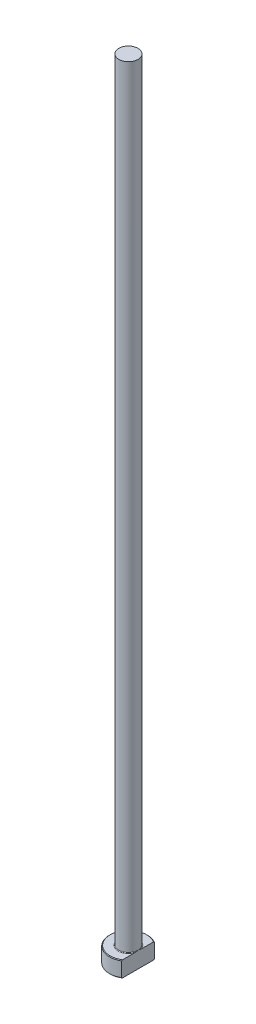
ISO-10303-21;
HEADER;
FILE_DESCRIPTION(('STEP AP214'),'2;1');
FILE_NAME('part.step','',(''),(''),'','','');
FILE_SCHEMA(('AUTOMOTIVE_DESIGN { 1 0 10303 214 1 1 1 1 }'));
ENDSEC;
DATA;
#1=APPLICATION_CONTEXT('core data for automotive mechanical design processes');
#2=APPLICATION_PROTOCOL_DEFINITION('international standard','automotive_design',2000,#1);
#3=PRODUCT_CONTEXT('',#1,'mechanical');
#4=PRODUCT('Part','Part','',(#3));
#5=PRODUCT_RELATED_PRODUCT_CATEGORY('part','',(#4));
#6=PRODUCT_DEFINITION_FORMATION('','',#4);
#7=PRODUCT_DEFINITION_CONTEXT('part definition',#1,'design');
#8=PRODUCT_DEFINITION('design','',#6,#7);
#9=PRODUCT_DEFINITION_SHAPE('','',#8);
#10=(LENGTH_UNIT() NAMED_UNIT(*) SI_UNIT(.MILLI.,.METRE.));
#11=(NAMED_UNIT(*) PLANE_ANGLE_UNIT() SI_UNIT($,.RADIAN.));
#12=(NAMED_UNIT(*) SI_UNIT($,.STERADIAN.) SOLID_ANGLE_UNIT());
#13=UNCERTAINTY_MEASURE_WITH_UNIT(LENGTH_MEASURE(1.E-05),#10,'distance_accuracy_value','');
#14=(GEOMETRIC_REPRESENTATION_CONTEXT(3) GLOBAL_UNCERTAINTY_ASSIGNED_CONTEXT((#13)) GLOBAL_UNIT_ASSIGNED_CONTEXT((#10,
#11,#12)) REPRESENTATION_CONTEXT('',''));
#15=CARTESIAN_POINT('',(0.,0.,0.));
#16=DIRECTION('',(0.,0.,1.));
#17=DIRECTION('',(1.,0.,0.));
#18=AXIS2_PLACEMENT_3D('',#15,#16,#17);
#19=CARTESIAN_POINT('',(0.,0.,0.));
#20=DIRECTION('',(0.,-1.,0.));
#21=DIRECTION('',(0.,0.,-1.));
#22=AXIS2_PLACEMENT_3D('',#19,#20,#21);
#23=PLANE('',#22);
#24=CARTESIAN_POINT('',(0.,0.,0.));
#25=DIRECTION('',(0.,-1.,0.));
#26=DIRECTION('',(0.,0.,-1.));
#27=AXIS2_PLACEMENT_3D('',#24,#25,#26);
#28=CIRCLE('',#27,5.79999999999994);
#29=CARTESIAN_POINT('',(3.04999999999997,0.,4.9333051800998));
#30=VERTEX_POINT('',#29);
#31=CARTESIAN_POINT('',(3.04999999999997,0.,-4.9333051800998));
#32=VERTEX_POINT('',#31);
#33=EDGE_CURVE('E98',#30,#32,#28,.T.);
#34=ORIENTED_EDGE('',*,*,#33,.T.);
#35=DIRECTION('',(0.,0.,1.));
#36=VECTOR('',#35,1.);
#37=CARTESIAN_POINT('',(3.04999999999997,0.,-5.16696235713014));
#38=LINE('',#37,#36);
#39=EDGE_CURVE('E83',#32,#30,#38,.T.);
#40=ORIENTED_EDGE('',*,*,#39,.T.);
#41=EDGE_LOOP('',(#34,#40));
#42=FACE_BOUND('',#41,.T.);
#43=ADVANCED_FACE('F32',(#42),#23,.T.);
#44=CARTESIAN_POINT('',(0.,259.958771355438,0.));
#45=DIRECTION('',(0.,1.,0.));
#46=DIRECTION('',(0.,0.,1.));
#47=AXIS2_PLACEMENT_3D('',#44,#45,#46);
#48=CYLINDRICAL_SURFACE('',#47,5.99999999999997);
#49=CARTESIAN_POINT('',(0.,4.80000000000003,0.));
#50=DIRECTION('',(0.,1.,0.));
#51=DIRECTION('',(0.,0.,1.));
#52=AXIS2_PLACEMENT_3D('',#49,#50,#51);
#53=CIRCLE('',#52,5.99999999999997);
#54=CARTESIAN_POINT('',(3.04999999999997,4.80000000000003,5.16696235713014));
#55=VERTEX_POINT('',#54);
#56=CARTESIAN_POINT('',(3.04999999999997,4.80000000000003,-5.16696235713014));
#57=VERTEX_POINT('',#56);
#58=EDGE_CURVE('E104',#55,#57,#53,.F.);
#59=ORIENTED_EDGE('',*,*,#58,.T.);
#60=DIRECTION('',(0.,-1.,0.));
#61=VECTOR('',#60,1.);
#62=CARTESIAN_POINT('',(3.04999999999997,250.,-5.16696235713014));
#63=LINE('',#62,#61);
#64=CARTESIAN_POINT('',(3.04999999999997,0.200000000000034,-5.16696235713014));
#65=VERTEX_POINT('',#64);
#66=EDGE_CURVE('E183',#57,#65,#63,.T.);
#67=ORIENTED_EDGE('',*,*,#66,.T.);
#68=CARTESIAN_POINT('',(0.,0.200000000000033,0.));
#69=DIRECTION('',(0.,-1.,0.));
#70=DIRECTION('',(0.,0.,-1.));
#71=AXIS2_PLACEMENT_3D('',#68,#69,#70);
#72=CIRCLE('',#71,5.99999999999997);
#73=CARTESIAN_POINT('',(3.04999999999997,0.200000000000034,5.16696235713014));
#74=VERTEX_POINT('',#73);
#75=EDGE_CURVE('E100',#65,#74,#72,.F.);
#76=ORIENTED_EDGE('',*,*,#75,.T.);
#77=DIRECTION('',(0.,-1.,0.));
#78=VECTOR('',#77,1.);
#79=CARTESIAN_POINT('',(3.04999999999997,250.,5.16696235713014));
#80=LINE('',#79,#78);
#81=EDGE_CURVE('E93',#55,#74,#80,.T.);
#82=ORIENTED_EDGE('',*,*,#81,.F.);
#83=EDGE_LOOP('',(#59,#67,#76,#82));
#84=FACE_BOUND('',#83,.T.);
#85=ADVANCED_FACE('F158',(#84),#48,.T.);
#86=CARTESIAN_POINT('',(-5.99999999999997,5.,0.));
#87=DIRECTION('',(0.,1.,0.));
#88=DIRECTION('',(0.,0.,1.));
#89=AXIS2_PLACEMENT_3D('',#86,#87,#88);
#90=PLANE('',#89);
#91=CARTESIAN_POINT('',(0.,5.,0.));
#92=DIRECTION('',(0.,1.,0.));
#93=DIRECTION('',(0.,0.,1.));
#94=AXIS2_PLACEMENT_3D('',#91,#92,#93);
#95=CIRCLE('',#94,5.79999999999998);
#96=CARTESIAN_POINT('',(3.04999999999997,5.,-4.93330518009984));
#97=VERTEX_POINT('',#96);
#98=CARTESIAN_POINT('',(3.04999999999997,5.,4.93330518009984));
#99=VERTEX_POINT('',#98);
#100=EDGE_CURVE('E178',#97,#99,#95,.T.);
#101=ORIENTED_EDGE('',*,*,#100,.T.);
#102=DIRECTION('',(0.,0.,-1.));
#103=VECTOR('',#102,1.);
#104=CARTESIAN_POINT('',(3.04999999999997,5.,0.));
#105=LINE('',#104,#103);
#106=CARTESIAN_POINT('',(3.04999999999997,4.99999999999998,1.12249721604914));
#107=VERTEX_POINT('',#106);
#108=EDGE_CURVE('E57',#99,#107,#105,.T.);
#109=ORIENTED_EDGE('',*,*,#108,.T.);
#110=CARTESIAN_POINT('',(0.,5.,0.));
#111=DIRECTION('',(0.,1.,0.));
#112=DIRECTION('',(0.,0.,1.));
#113=AXIS2_PLACEMENT_3D('',#110,#111,#112);
#114=CIRCLE('',#113,3.24999999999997);
#115=CARTESIAN_POINT('',(3.04999999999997,4.99999999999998,-1.12249721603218));
#116=VERTEX_POINT('',#115);
#117=EDGE_CURVE('E107',#107,#116,#114,.F.);
#118=ORIENTED_EDGE('',*,*,#117,.T.);
#119=EDGE_CURVE('E136',#116,#97,#105,.T.);
#120=ORIENTED_EDGE('',*,*,#119,.T.);
#121=EDGE_LOOP('',(#101,#109,#118,#120));
#122=FACE_BOUND('',#121,.T.);
#123=ADVANCED_FACE('F147',(#122),#90,.T.);
#124=CARTESIAN_POINT('',(0.,5.,0.));
#125=DIRECTION('',(0.,-1.,0.));
#126=DIRECTION('',(0.,0.,-1.));
#127=AXIS2_PLACEMENT_3D('',#124,#125,#126);
#128=CONICAL_SURFACE('',#127,5.79999999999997,0.785398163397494);
#129=ORIENTED_EDGE('',*,*,#58,.F.);
#130=CARTESIAN_POINT('',(3.04999999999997,-0.970698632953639,11.3686783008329));
#131=CARTESIAN_POINT('',(3.04999999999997,-0.729844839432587,11.1192942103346));
#132=CARTESIAN_POINT('',(3.04999999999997,-0.489253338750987,10.8696559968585));
#133=CARTESIAN_POINT('',(3.04999999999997,-0.00874272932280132,10.3697279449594));
#134=CARTESIAN_POINT('',(3.04999999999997,0.231176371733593,10.1194380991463));
#135=CARTESIAN_POINT('',(3.04999999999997,0.71029504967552,9.61795795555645));
#136=CARTESIAN_POINT('',(3.04999999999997,0.949494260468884,9.36676730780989));
#137=CARTESIAN_POINT('',(3.04999999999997,1.42684960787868,8.86339876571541));
#138=CARTESIAN_POINT('',(3.04999999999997,1.66500575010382,8.61122087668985));
#139=CARTESIAN_POINT('',(3.04999999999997,2.13559657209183,8.1102790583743));
#140=CARTESIAN_POINT('',(3.04999999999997,2.36805568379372,7.86153809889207));
#141=CARTESIAN_POINT('',(3.04999999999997,2.83129526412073,7.36249846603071));
#142=CARTESIAN_POINT('',(3.04999999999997,3.0620757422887,7.11219980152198));
#143=CARTESIAN_POINT('',(3.04999999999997,3.52134632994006,6.60959354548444));
#144=CARTESIAN_POINT('',(3.04999999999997,3.74983686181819,6.35728634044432));
#145=CARTESIAN_POINT('',(3.04999999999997,4.20371775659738,5.84990299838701));
#146=CARTESIAN_POINT('',(3.04999999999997,4.42910822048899,5.5948269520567));
#147=CARTESIAN_POINT('',(3.04999999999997,4.79887807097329,5.16894007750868));
#148=CARTESIAN_POINT('',(3.04999999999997,4.94452846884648,4.99923427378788));
#149=CARTESIAN_POINT('',(3.04999999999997,5.23331494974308,4.65766279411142));
#150=CARTESIAN_POINT('',(3.04999999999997,5.37645078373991,4.48579690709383));
#151=CARTESIAN_POINT('',(3.04999999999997,5.6607909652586,4.1375355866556));
#152=CARTESIAN_POINT('',(3.04999999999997,5.80196080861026,3.96111185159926));
#153=CARTESIAN_POINT('',(3.04999999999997,6.07950752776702,3.60459087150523));
#154=CARTESIAN_POINT('',(3.04999999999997,6.21588558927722,3.42449455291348));
#155=CARTESIAN_POINT('',(3.04999999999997,6.48382052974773,3.05665019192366));
#156=CARTESIAN_POINT('',(3.04999999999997,6.61527833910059,2.86882893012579));
#157=CARTESIAN_POINT('',(3.04999999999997,6.8046656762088,2.58172885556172));
#158=CARTESIAN_POINT('',(3.04999999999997,6.86653995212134,2.48505688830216));
#159=CARTESIAN_POINT('',(3.04999999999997,6.98697221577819,2.28967595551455));
#160=CARTESIAN_POINT('',(3.04999999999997,7.04553056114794,2.19096721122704));
#161=CARTESIAN_POINT('',(3.04999999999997,7.1578414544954,1.99234566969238));
#162=CARTESIAN_POINT('',(3.04999999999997,7.21164228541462,1.89246054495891));
#163=CARTESIAN_POINT('',(3.04999999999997,7.31412145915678,1.69011096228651));
#164=CARTESIAN_POINT('',(3.04999999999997,7.36279884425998,1.58764602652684));
#165=CARTESIAN_POINT('',(3.04999999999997,7.498910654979,1.27646394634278));
#166=CARTESIAN_POINT('',(3.04999999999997,7.57686498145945,1.06321933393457));
#167=CARTESIAN_POINT('',(3.04999999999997,7.66214701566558,0.74370706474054));
#168=CARTESIAN_POINT('',(3.04999999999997,7.68491750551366,0.641524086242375));
#169=CARTESIAN_POINT('',(3.04999999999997,7.72074349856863,0.435432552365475));
#170=CARTESIAN_POINT('',(3.04999999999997,7.73379998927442,0.331524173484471));
#171=CARTESIAN_POINT('',(3.04999999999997,7.74926869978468,0.123282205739));
#172=CARTESIAN_POINT('',(3.04999999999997,7.75171909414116,0.0189514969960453));
#173=CARTESIAN_POINT('',(3.04999999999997,7.7458996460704,-0.189412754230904));
#174=CARTESIAN_POINT('',(3.04999999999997,7.73762904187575,-0.293446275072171));
#175=CARTESIAN_POINT('',(3.04999999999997,7.71106535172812,-0.499372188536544));
#176=CARTESIAN_POINT('',(3.04999999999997,7.6928510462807,-0.60127495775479));
#177=CARTESIAN_POINT('',(3.04999999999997,7.64758004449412,-0.803076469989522));
#178=CARTESIAN_POINT('',(3.04999999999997,7.62052218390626,-0.902974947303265));
#179=CARTESIAN_POINT('',(3.04999999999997,7.55873377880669,-1.10100969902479));
#180=CARTESIAN_POINT('',(3.04999999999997,7.52395724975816,-1.19913143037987));
#181=CARTESIAN_POINT('',(3.04999999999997,7.44818034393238,-1.39288710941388));
#182=CARTESIAN_POINT('',(3.04999999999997,7.40718118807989,-1.48852154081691));
#183=CARTESIAN_POINT('',(3.04999999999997,7.27880199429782,-1.76725558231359));
#184=CARTESIAN_POINT('',(3.04999999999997,7.18437453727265,-1.94709912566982));
#185=CARTESIAN_POINT('',(3.04999999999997,6.9829288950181,-2.29966178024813));
#186=CARTESIAN_POINT('',(3.04999999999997,6.87589523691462,-2.47237177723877));
#187=CARTESIAN_POINT('',(3.04999999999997,6.65293850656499,-2.81286471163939));
#188=CARTESIAN_POINT('',(3.04999999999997,6.53698257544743,-2.9806259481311));
#189=CARTESIAN_POINT('',(3.04999999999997,6.29920889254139,-3.31177740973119));
#190=CARTESIAN_POINT('',(3.04999999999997,6.17739401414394,-3.47516971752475));
#191=CARTESIAN_POINT('',(3.04999999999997,5.9279048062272,-3.80077365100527));
#192=CARTESIAN_POINT('',(3.04999999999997,5.80017502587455,-3.96294258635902));
#193=CARTESIAN_POINT('',(3.04999999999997,5.54148279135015,-4.28469855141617));
#194=CARTESIAN_POINT('',(3.04999999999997,5.41052000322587,-4.44428531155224));
#195=CARTESIAN_POINT('',(3.04999999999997,5.14647056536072,-4.76104235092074));
#196=CARTESIAN_POINT('',(3.04999999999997,5.01338972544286,-4.91821748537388));
#197=CARTESIAN_POINT('',(3.04999999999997,4.74534141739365,-5.23095234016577));
#198=CARTESIAN_POINT('',(3.04999999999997,4.61037391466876,-5.3865120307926));
#199=CARTESIAN_POINT('',(3.04999999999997,4.25119607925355,-5.7965100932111));
#200=CARTESIAN_POINT('',(3.04999999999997,4.02571738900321,-6.04983649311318));
#201=CARTESIAN_POINT('',(3.04999999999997,3.57194090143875,-6.55395552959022));
#202=CARTESIAN_POINT('',(3.04999999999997,3.34364302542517,-6.80474809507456));
#203=CARTESIAN_POINT('',(3.04999999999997,2.88477169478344,-7.30466840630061));
#204=CARTESIAN_POINT('',(3.04999999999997,2.65419632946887,-7.55379439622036));
#205=CARTESIAN_POINT('',(3.04999999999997,2.19148976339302,-8.05059711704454));
#206=CARTESIAN_POINT('',(3.04999999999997,1.9593585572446,-8.29827384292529));
#207=CARTESIAN_POINT('',(3.04999999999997,1.50341144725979,-8.78239136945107));
#208=CARTESIAN_POINT('',(3.04999999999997,1.27964364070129,-9.01887750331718));
#209=CARTESIAN_POINT('',(3.04999999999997,0.831227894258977,-9.49101521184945));
#210=CARTESIAN_POINT('',(3.04999999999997,0.606579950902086,-9.72666678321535));
#211=CARTESIAN_POINT('',(3.04999999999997,0.156823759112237,-10.1970312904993));
#212=CARTESIAN_POINT('',(3.04999999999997,-0.0682837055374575,-10.431744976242));
#213=CARTESIAN_POINT('',(3.04999999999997,-0.519082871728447,-10.9006068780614));
#214=CARTESIAN_POINT('',(3.04999999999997,-0.744774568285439,-11.1347550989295));
#215=CARTESIAN_POINT('',(3.04999999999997,-0.970698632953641,-11.3686783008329));
#216=B_SPLINE_CURVE_WITH_KNOTS('',3,(#130,#131,#132,#133,#134,#135,#136,#137,#138,#139,#140,
#141,#142,#143,#144,#145,#146,#147,#148,#149,#150,#151,#152,#153,#154,#155,#156,#157,#158,#159,
#160,#161,#162,#163,#164,#165,#166,#167,#168,#169,#170,#171,#172,#173,#174,#175,#176,#177,#178,
#179,#180,#181,#182,#183,#184,#185,#186,#187,#188,#189,#190,#191,#192,#193,#194,#195,#196,#197,
#198,#199,#200,#201,#202,#203,#204,#205,#206,#207,#208,#209,#210,#211,#212,#213,#214,#215),
.UNSPECIFIED.,.F.,.F.,(4,2,2,2,2,2,2,2,2,2,2,2,2,2,2,2,2,2,2,2,2,2,2,2,2,2,2,2,2,2,2,2,2,2,2,2,
2,2,2,2,2,2,4),(0.,1.04010969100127,2.08023122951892,3.120813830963,4.16139083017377,
5.1827488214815,6.20410100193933,7.22526118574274,8.24638802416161,8.9172846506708,
9.58824734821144,10.2660415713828,10.9436668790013,11.6311554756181,11.9754354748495,
12.3196782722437,12.6598862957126,13.0001578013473,13.6781281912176,13.9918165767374,
14.3054730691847,14.6179996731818,14.9305484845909,15.2406562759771,15.5508049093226,
15.8628533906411,16.1748407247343,16.7833414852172,17.3925970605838,18.0042149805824,
18.6155359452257,19.2347734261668,19.8540751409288,20.4718999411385,21.0897360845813,
22.1071178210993,23.1245280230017,24.1428799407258,25.1612353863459,26.137951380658,
27.1146712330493,28.0903109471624,29.0659423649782),.UNSPECIFIED.);
#217=EDGE_CURVE('E135',#55,#99,#216,.T.);
#218=ORIENTED_EDGE('',*,*,#217,.T.);
#219=ORIENTED_EDGE('',*,*,#100,.F.);
#220=EDGE_CURVE('E127',#97,#57,#216,.T.);
#221=ORIENTED_EDGE('',*,*,#220,.T.);
#222=EDGE_LOOP('',(#129,#218,#219,#221));
#223=FACE_BOUND('',#222,.T.);
#224=ADVANCED_FACE('F143',(#223),#128,.T.);
#225=CARTESIAN_POINT('',(0.,0.200000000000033,0.));
#226=DIRECTION('',(0.,1.,0.));
#227=DIRECTION('',(0.,0.,1.));
#228=AXIS2_PLACEMENT_3D('',#225,#226,#227);
#229=CONICAL_SURFACE('',#228,5.99999999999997,0.785398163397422);
#230=ORIENTED_EDGE('',*,*,#75,.F.);
#231=CARTESIAN_POINT('',(3.04999999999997,5.97069863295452,-11.3686783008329));
#232=CARTESIAN_POINT('',(3.04999999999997,5.72984483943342,-11.1192942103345));
#233=CARTESIAN_POINT('',(3.04999999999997,5.48925333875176,-10.8696559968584));
#234=CARTESIAN_POINT('',(3.04999999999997,5.00874272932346,-10.3697279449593));
#235=CARTESIAN_POINT('',(3.04999999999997,4.76882362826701,-10.1194380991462));
#236=CARTESIAN_POINT('',(3.04999999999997,4.28970495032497,-9.61795795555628));
#237=CARTESIAN_POINT('',(3.04999999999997,4.05050573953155,-9.3667673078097));
#238=CARTESIAN_POINT('',(3.04999999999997,3.57315039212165,-8.86339876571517));
#239=CARTESIAN_POINT('',(3.04999999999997,3.33499424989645,-8.6112208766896));
#240=CARTESIAN_POINT('',(3.04999999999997,2.86440342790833,-8.110279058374));
#241=CARTESIAN_POINT('',(3.04999999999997,2.63194431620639,-7.86153809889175));
#242=CARTESIAN_POINT('',(3.04999999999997,2.16870473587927,-7.36249846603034));
#243=CARTESIAN_POINT('',(3.04999999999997,1.93792425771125,-7.11219980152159));
#244=CARTESIAN_POINT('',(3.04999999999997,1.47865367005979,-6.60959354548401));
#245=CARTESIAN_POINT('',(3.04999999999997,1.25016313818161,-6.35728634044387));
#246=CARTESIAN_POINT('',(3.04999999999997,0.796282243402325,-5.84990299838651));
#247=CARTESIAN_POINT('',(3.04999999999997,0.57089177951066,-5.59482695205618));
#248=CARTESIAN_POINT('',(3.04999999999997,0.201121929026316,-5.16894007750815));
#249=CARTESIAN_POINT('',(3.04999999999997,0.0554715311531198,-4.99923427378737));
#250=CARTESIAN_POINT('',(3.04999999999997,-0.233314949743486,-4.65766279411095));
#251=CARTESIAN_POINT('',(3.04999999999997,-0.376450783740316,-4.48579690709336));
#252=CARTESIAN_POINT('',(3.04999999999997,-0.660790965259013,-4.13753558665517));
#253=CARTESIAN_POINT('',(3.04999999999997,-0.801960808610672,-3.96111185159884));
#254=CARTESIAN_POINT('',(3.04999999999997,-1.07950752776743,-3.60459087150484));
#255=CARTESIAN_POINT('',(3.04999999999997,-1.21588558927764,-3.42449455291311));
#256=CARTESIAN_POINT('',(3.04999999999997,-1.48382052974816,-3.05665019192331));
#257=CARTESIAN_POINT('',(3.04999999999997,-1.61527833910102,-2.86882893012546));
#258=CARTESIAN_POINT('',(3.04999999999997,-1.80466567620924,-2.5817288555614));
#259=CARTESIAN_POINT('',(3.04999999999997,-1.86653995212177,-2.48505688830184));
#260=CARTESIAN_POINT('',(3.04999999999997,-1.98697221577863,-2.28967595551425));
#261=CARTESIAN_POINT('',(3.04999999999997,-2.04553056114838,-2.19096721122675));
#262=CARTESIAN_POINT('',(3.04999999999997,-2.15784145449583,-1.99234566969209));
#263=CARTESIAN_POINT('',(3.04999999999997,-2.21164228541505,-1.89246054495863));
#264=CARTESIAN_POINT('',(3.04999999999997,-2.31412145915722,-1.69011096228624));
#265=CARTESIAN_POINT('',(3.04999999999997,-2.36279884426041,-1.58764602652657));
#266=CARTESIAN_POINT('',(3.04999999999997,-2.49891065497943,-1.27646394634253));
#267=CARTESIAN_POINT('',(3.04999999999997,-2.57686498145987,-1.06321933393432));
#268=CARTESIAN_POINT('',(3.04999999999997,-2.66214701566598,-0.743707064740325));
#269=CARTESIAN_POINT('',(3.04999999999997,-2.68491750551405,-0.641524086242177));
#270=CARTESIAN_POINT('',(3.04999999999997,-2.720743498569,-0.435432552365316));
#271=CARTESIAN_POINT('',(3.04999999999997,-2.7337999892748,-0.331524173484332));
#272=CARTESIAN_POINT('',(3.04999999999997,-2.74926869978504,-0.123282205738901));
#273=CARTESIAN_POINT('',(3.04999999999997,-2.75171909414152,-0.0189514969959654));
#274=CARTESIAN_POINT('',(3.04999999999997,-2.74589964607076,0.189412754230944));
#275=CARTESIAN_POINT('',(3.04999999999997,-2.73762904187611,0.293446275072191));
#276=CARTESIAN_POINT('',(3.04999999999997,-2.71106535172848,0.499372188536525));
#277=CARTESIAN_POINT('',(3.04999999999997,-2.69285104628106,0.601274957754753));
#278=CARTESIAN_POINT('',(3.04999999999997,-2.64758004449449,0.803076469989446));
#279=CARTESIAN_POINT('',(3.04999999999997,-2.62052218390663,0.90297494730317));
#280=CARTESIAN_POINT('',(3.04999999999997,-2.55873377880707,1.10100969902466));
#281=CARTESIAN_POINT('',(3.04999999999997,-2.52395724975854,1.19913143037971));
#282=CARTESIAN_POINT('',(3.04999999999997,-2.44818034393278,1.39288710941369));
#283=CARTESIAN_POINT('',(3.04999999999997,-2.40718118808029,1.4885215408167));
#284=CARTESIAN_POINT('',(3.04999999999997,-2.27880199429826,1.76725558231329));
#285=CARTESIAN_POINT('',(3.04999999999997,-2.18437453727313,1.94709912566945));
#286=CARTESIAN_POINT('',(3.04999999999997,-1.98292889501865,2.29966178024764));
#287=CARTESIAN_POINT('',(3.04999999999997,-1.87589523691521,2.47237177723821));
#288=CARTESIAN_POINT('',(3.04999999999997,-1.65293850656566,2.8128647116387));
#289=CARTESIAN_POINT('',(3.04999999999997,-1.53698257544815,2.98062594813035));
#290=CARTESIAN_POINT('',(3.04999999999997,-1.29920889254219,3.31177740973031));
#291=CARTESIAN_POINT('',(3.04999999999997,-1.17739401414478,3.47516971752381));
#292=CARTESIAN_POINT('',(3.04999999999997,-0.927904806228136,3.80077365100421));
#293=CARTESIAN_POINT('',(3.04999999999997,-0.800175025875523,3.96294258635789));
#294=CARTESIAN_POINT('',(3.04999999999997,-0.541482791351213,4.28469855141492));
#295=CARTESIAN_POINT('',(3.04999999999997,-0.410520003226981,4.44428531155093));
#296=CARTESIAN_POINT('',(3.04999999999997,-0.146470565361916,4.7610423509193));
#297=CARTESIAN_POINT('',(3.04999999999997,-0.0133897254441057,4.91821748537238));
#298=CARTESIAN_POINT('',(3.04999999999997,0.254658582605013,5.23095234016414));
#299=CARTESIAN_POINT('',(3.04999999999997,0.389626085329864,5.38651203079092));
#300=CARTESIAN_POINT('',(3.04999999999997,0.748803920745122,5.79651009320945));
#301=CARTESIAN_POINT('',(3.04999999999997,0.974282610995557,6.04983649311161));
#302=CARTESIAN_POINT('',(3.04999999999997,1.42805909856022,6.55395552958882));
#303=CARTESIAN_POINT('',(3.04999999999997,1.65635697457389,6.80474809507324));
#304=CARTESIAN_POINT('',(3.04999999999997,2.11522830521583,7.30466840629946));
#305=CARTESIAN_POINT('',(3.04999999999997,2.34580367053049,7.55379439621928));
#306=CARTESIAN_POINT('',(3.04999999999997,2.80851023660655,8.05059711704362));
#307=CARTESIAN_POINT('',(3.04999999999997,3.04064144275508,8.29827384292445));
#308=CARTESIAN_POINT('',(3.04999999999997,3.49658855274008,8.78239136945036));
#309=CARTESIAN_POINT('',(3.04999999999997,3.72035635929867,9.01887750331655));
#310=CARTESIAN_POINT('',(3.04999999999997,4.16877210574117,9.49101521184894));
#311=CARTESIAN_POINT('',(3.04999999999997,4.39342004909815,9.72666678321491));
#312=CARTESIAN_POINT('',(3.04999999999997,4.84317624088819,10.197031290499));
#313=CARTESIAN_POINT('',(3.04999999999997,5.06828370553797,10.4317449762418));
#314=CARTESIAN_POINT('',(3.04999999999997,5.51908287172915,10.9006068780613));
#315=CARTESIAN_POINT('',(3.04999999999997,5.74477456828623,11.1347550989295));
#316=CARTESIAN_POINT('',(3.04999999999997,5.97069863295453,11.3686783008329));
#317=B_SPLINE_CURVE_WITH_KNOTS('',3,(#231,#232,#233,#234,#235,#236,#237,#238,#239,#240,#241,
#242,#243,#244,#245,#246,#247,#248,#249,#250,#251,#252,#253,#254,#255,#256,#257,#258,#259,#260,
#261,#262,#263,#264,#265,#266,#267,#268,#269,#270,#271,#272,#273,#274,#275,#276,#277,#278,#279,
#280,#281,#282,#283,#284,#285,#286,#287,#288,#289,#290,#291,#292,#293,#294,#295,#296,#297,#298,
#299,#300,#301,#302,#303,#304,#305,#306,#307,#308,#309,#310,#311,#312,#313,#314,#315,#316),
.UNSPECIFIED.,.F.,.F.,(4,2,2,2,2,2,2,2,2,2,2,2,2,2,2,2,2,2,2,2,2,2,2,2,2,2,2,2,2,2,2,2,2,2,2,2,
2,2,2,2,2,2,4),(0.,1.04010969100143,2.08023122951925,3.1208138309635,4.16139083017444,
5.18274882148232,6.2041010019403,7.22526118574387,8.24638802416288,8.91728465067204,
9.58824734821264,10.266041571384,10.9436668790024,11.6311554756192,11.9754354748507,
12.3196782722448,12.6598862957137,13.0001578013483,13.6781281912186,13.9918165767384,
14.3054730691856,14.6179996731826,14.9305484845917,15.2406562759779,15.5508049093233,
15.8628533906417,16.1748407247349,16.7833414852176,17.3925970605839,18.0042149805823,
18.6155359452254,19.2347734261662,19.854075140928,20.4718999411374,21.0897360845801,
22.1071178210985,23.1245280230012,24.1428799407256,25.1612353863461,26.1379513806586,
27.1146712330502,28.0903109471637,29.0659423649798),.UNSPECIFIED.);
#318=EDGE_CURVE('E86',#65,#32,#317,.T.);
#319=ORIENTED_EDGE('',*,*,#318,.T.);
#320=ORIENTED_EDGE('',*,*,#33,.F.);
#321=EDGE_CURVE('E89',#30,#74,#317,.T.);
#322=ORIENTED_EDGE('',*,*,#321,.T.);
#323=EDGE_LOOP('',(#230,#319,#320,#322));
#324=FACE_BOUND('',#323,.T.);
#325=ADVANCED_FACE('F97',(#324),#229,.T.);
#326=CARTESIAN_POINT('',(0.,5.19999999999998,0.));
#327=DIRECTION('',(0.,1.,0.));
#328=DIRECTION('',(0.,0.,1.));
#329=AXIS2_PLACEMENT_3D('',#326,#327,#328);
#330=TOROIDAL_SURFACE('',#329,3.24999999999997,0.2);
#331=CARTESIAN_POINT('',(3.04999999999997,5.19999999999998,0.));
#332=CARTESIAN_POINT('',(3.04999999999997,5.20000050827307,1.21234498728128E-10));
#333=CARTESIAN_POINT('',(3.04999999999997,5.2000010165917,-1.94554167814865E-07));
#334=CARTESIAN_POINT('',(3.04999999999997,5.20000196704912,-7.36231908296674E-07));
#335=CARTESIAN_POINT('',(3.04999999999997,5.20000239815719,-1.09605845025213E-06));
#336=CARTESIAN_POINT('',(3.04999999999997,5.20000329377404,-1.95768484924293E-06));
#337=CARTESIAN_POINT('',(3.04999999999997,5.20000374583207,-2.47339958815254E-06));
#338=CARTESIAN_POINT('',(3.04999999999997,5.20000455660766,-3.54344299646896E-06));
#339=CARTESIAN_POINT('',(3.04999999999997,5.20000491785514,-4.0960013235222E-06));
#340=CARTESIAN_POINT('',(3.04999999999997,5.20000625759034,-6.23288240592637E-06));
#341=CARTESIAN_POINT('',(3.04999999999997,5.20000716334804,-7.86540857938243E-06));
#342=CARTESIAN_POINT('',(3.04999999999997,5.20000865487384,-1.11012618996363E-05));
#343=CARTESIAN_POINT('',(3.04999999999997,5.20000926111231,-1.26955485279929E-05));
#344=CARTESIAN_POINT('',(3.04999999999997,5.20001180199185,-1.94350330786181E-05));
#345=CARTESIAN_POINT('',(3.04999999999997,5.20001369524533,-2.45990996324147E-05));
#346=CARTESIAN_POINT('',(3.04999999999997,5.20001648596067,-3.43608245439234E-05));
#347=CARTESIAN_POINT('',(3.04999999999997,5.20001748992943,-3.892785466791E-05));
#348=CARTESIAN_POINT('',(3.04999999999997,5.20002479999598,-7.28490938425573E-05));
#349=CARTESIAN_POINT('',(3.04999999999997,5.20003033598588,-0.000102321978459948));
#350=CARTESIAN_POINT('',(3.04999999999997,5.2000545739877,-0.000218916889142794));
#351=CARTESIAN_POINT('',(3.04999999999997,5.20007771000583,-0.000305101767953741));
#352=CARTESIAN_POINT('',(3.04999999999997,5.20016793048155,-0.000646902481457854));
#353=CARTESIAN_POINT('',(3.04999999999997,5.20023214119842,-0.00090303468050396));
#354=CARTESIAN_POINT('',(3.04999999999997,5.20048959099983,-0.00192235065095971));
#355=CARTESIAN_POINT('',(3.04999999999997,5.200686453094,-0.00268486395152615));
#356=CARTESIAN_POINT('',(3.04999999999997,5.20150513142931,-0.0058644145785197));
#357=CARTESIAN_POINT('',(3.04999999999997,5.20212238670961,-0.00828229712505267));
#358=CARTESIAN_POINT('',(3.04999999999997,5.20733075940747,-0.0286735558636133));
#359=CARTESIAN_POINT('',(3.04999999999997,5.21193872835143,-0.0466439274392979));
#360=CARTESIAN_POINT('',(3.04999999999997,5.22094200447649,-0.0818758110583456));
#361=CARTESIAN_POINT('',(3.04999999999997,5.22533847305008,-0.0991370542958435));
#362=CARTESIAN_POINT('',(3.04999999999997,5.23964641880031,-0.155525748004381));
#363=CARTESIAN_POINT('',(3.04999999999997,5.24949334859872,-0.194669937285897));
#364=CARTESIAN_POINT('',(3.04999999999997,5.26604342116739,-0.261710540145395));
#365=CARTESIAN_POINT('',(3.04999999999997,5.27283214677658,-0.289585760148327));
#366=CARTESIAN_POINT('',(3.04999999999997,5.28599220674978,-0.344649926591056));
#367=CARTESIAN_POINT('',(3.04999999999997,5.29236984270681,-0.371837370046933));
#368=CARTESIAN_POINT('',(3.04999999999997,5.31157589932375,-0.455723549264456));
#369=CARTESIAN_POINT('',(3.04999999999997,5.32392035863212,-0.512535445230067));
#370=CARTESIAN_POINT('',(3.04999999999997,5.34680977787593,-0.627095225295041));
#371=CARTESIAN_POINT('',(3.04999999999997,5.35733631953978,-0.684846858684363));
#372=CARTESIAN_POINT('',(3.04999999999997,5.37641100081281,-0.805890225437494));
#373=CARTESIAN_POINT('',(3.04999999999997,5.38470472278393,-0.869223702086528));
#374=CARTESIAN_POINT('',(3.04999999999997,5.39650442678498,-0.996147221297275));
#375=CARTESIAN_POINT('',(3.04999999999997,5.40002782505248,-1.05973547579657));
#376=CARTESIAN_POINT('',(3.04999999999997,5.39997784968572,-1.17309949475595));
#377=CARTESIAN_POINT('',(3.04999999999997,5.39778745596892,-1.22285605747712));
#378=CARTESIAN_POINT('',(3.04999999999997,5.38969143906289,-1.29668621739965));
#379=CARTESIAN_POINT('',(3.04999999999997,5.38622595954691,-1.32101834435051));
#380=CARTESIAN_POINT('',(3.04999999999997,5.37728481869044,-1.36928415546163));
#381=CARTESIAN_POINT('',(3.04999999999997,5.37181197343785,-1.39321834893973));
#382=CARTESIAN_POINT('',(3.04999999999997,5.35809904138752,-1.44077878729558));
#383=CARTESIAN_POINT('',(3.04999999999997,5.34981429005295,-1.46439322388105));
#384=CARTESIAN_POINT('',(3.04999999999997,5.33448033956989,-1.49846738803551));
#385=CARTESIAN_POINT('',(3.04999999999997,5.3288970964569,-1.5095822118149));
#386=CARTESIAN_POINT('',(3.04999999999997,5.3165352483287,-1.53111652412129));
#387=CARTESIAN_POINT('',(3.04999999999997,5.30975936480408,-1.54153752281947));
#388=CARTESIAN_POINT('',(3.04999999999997,5.29649230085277,-1.55894178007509));
#389=CARTESIAN_POINT('',(3.04999999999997,5.29030904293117,-1.56615709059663));
#390=CARTESIAN_POINT('',(3.04999999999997,5.27693406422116,-1.57958549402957));
#391=CARTESIAN_POINT('',(3.04999999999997,5.26974514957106,-1.58580127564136));
#392=CARTESIAN_POINT('',(3.04999999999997,5.25691386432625,-1.5948473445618));
#393=CARTESIAN_POINT('',(3.04999999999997,5.25157849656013,-1.59810970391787));
#394=CARTESIAN_POINT('',(3.04999999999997,5.24045977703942,-1.60376515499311));
#395=CARTESIAN_POINT('',(3.04999999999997,5.23467674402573,-1.60615885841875));
#396=CARTESIAN_POINT('',(3.04999999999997,5.22270107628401,-1.60988393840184));
#397=CARTESIAN_POINT('',(3.04999999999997,5.21650471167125,-1.61120363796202));
#398=CARTESIAN_POINT('',(3.04999999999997,5.2039743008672,-1.61257691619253));
#399=CARTESIAN_POINT('',(3.04999999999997,5.19764039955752,-1.61263176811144));
#400=CARTESIAN_POINT('',(3.04999999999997,5.18599578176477,-1.6115568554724));
#401=CARTESIAN_POINT('',(3.04999999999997,5.18066847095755,-1.61059566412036));
#402=CARTESIAN_POINT('',(3.04999999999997,5.17023814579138,-1.60783192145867));
#403=CARTESIAN_POINT('',(3.04999999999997,5.16513526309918,-1.60602888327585));
#404=CARTESIAN_POINT('',(3.04999999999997,5.1534435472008,-1.60092650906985));
#405=CARTESIAN_POINT('',(3.04999999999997,5.14698890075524,-1.59732150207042));
#406=CARTESIAN_POINT('',(3.04999999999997,5.13473509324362,-1.58913221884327));
#407=CARTESIAN_POINT('',(3.04999999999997,5.12893753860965,-1.58454561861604));
#408=CARTESIAN_POINT('',(3.04999999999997,5.11462865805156,-1.571659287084));
#409=CARTESIAN_POINT('',(3.04999999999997,5.10662306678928,-1.56280289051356));
#410=CARTESIAN_POINT('',(3.04999999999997,5.09200345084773,-1.54403227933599));
#411=CARTESIAN_POINT('',(3.04999999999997,5.08539179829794,-1.53411630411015));
#412=CARTESIAN_POINT('',(3.04999999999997,5.06752820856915,-1.50390051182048));
#413=CARTESIAN_POINT('',(3.04999999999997,5.05783763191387,-1.48268800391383));
#414=CARTESIAN_POINT('',(3.04999999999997,5.04132960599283,-1.43906853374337));
#415=CARTESIAN_POINT('',(3.04999999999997,5.03453663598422,-1.41665312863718));
#416=CARTESIAN_POINT('',(3.04999999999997,5.0206522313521,-1.36141193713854));
#417=CARTESIAN_POINT('',(3.04999999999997,5.01471674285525,-1.32829980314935));
#418=CARTESIAN_POINT('',(3.04999999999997,5.0059927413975,-1.26161040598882));
#419=CARTESIAN_POINT('',(3.04999999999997,5.00321404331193,-1.22803201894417));
#420=CARTESIAN_POINT('',(3.04999999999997,5.00011178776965,-1.16191365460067));
#421=CARTESIAN_POINT('',(3.04999999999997,4.99970809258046,-1.12937711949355));
#422=CARTESIAN_POINT('',(3.04999999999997,5.0006737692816,-1.06450961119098));
#423=CARTESIAN_POINT('',(3.04999999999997,5.00203387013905,-1.03217845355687));
#424=CARTESIAN_POINT('',(3.04999999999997,5.00868972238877,-0.928108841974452));
#425=CARTESIAN_POINT('',(3.04999999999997,5.0167646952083,-0.856551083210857));
#426=CARTESIAN_POINT('',(3.04999999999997,5.03767337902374,-0.712390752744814));
#427=CARTESIAN_POINT('',(3.04999999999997,5.05061983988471,-0.639806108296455));
#428=CARTESIAN_POINT('',(3.04999999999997,5.07500705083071,-0.518012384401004));
#429=CARTESIAN_POINT('',(3.04999999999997,5.08563897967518,-0.468637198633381));
#430=CARTESIAN_POINT('',(3.04999999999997,5.10778639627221,-0.370668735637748));
#431=CARTESIAN_POINT('',(3.04999999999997,5.11929064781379,-0.322072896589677));
#432=CARTESIAN_POINT('',(3.04999999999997,5.14155853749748,-0.230580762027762));
#433=CARTESIAN_POINT('',(3.04999999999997,5.15225641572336,-0.18766821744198));
#434=CARTESIAN_POINT('',(3.04999999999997,5.17439488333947,-0.100070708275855));
#435=CARTESIAN_POINT('',(3.04999999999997,5.18584763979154,-0.0553887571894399));
#436=CARTESIAN_POINT('',(3.04999999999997,5.19787889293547,-0.00827685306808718));
#437=CARTESIAN_POINT('',(3.04999999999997,5.19849761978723,-0.00585356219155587));
#438=CARTESIAN_POINT('',(3.04999999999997,5.19931663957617,-0.00267278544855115));
#439=CARTESIAN_POINT('',(3.04999999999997,5.19951241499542,-0.00191446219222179));
#440=CARTESIAN_POINT('',(3.04999999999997,5.19976854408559,-0.000900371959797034));
#441=CARTESIAN_POINT('',(3.04999999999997,5.19983249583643,-0.000645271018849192));
#442=CARTESIAN_POINT('',(3.04999999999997,5.19992240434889,-0.000304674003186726));
#443=CARTESIAN_POINT('',(3.04999999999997,5.19994549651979,-0.000218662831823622));
#444=CARTESIAN_POINT('',(3.04999999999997,5.19996969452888,-0.000102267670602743));
#445=CARTESIAN_POINT('',(3.04999999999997,5.19997522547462,-7.28190159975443E-05));
#446=CARTESIAN_POINT('',(3.04999999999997,5.19998252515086,-3.89225111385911E-05));
#447=CARTESIAN_POINT('',(3.04999999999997,5.19998352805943,-3.43568150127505E-05));
#448=CARTESIAN_POINT('',(3.04999999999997,5.19998631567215,-2.45978369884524E-05));
#449=CARTESIAN_POINT('',(3.04999999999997,5.1999882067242,-1.94351124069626E-05));
#450=CARTESIAN_POINT('',(3.04999999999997,5.1999907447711,-1.26970231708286E-05));
#451=CARTESIAN_POINT('',(3.04999999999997,5.19999135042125,-1.11028362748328E-05));
#452=CARTESIAN_POINT('',(3.04999999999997,5.1999928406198,-7.86708671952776E-06));
#453=CARTESIAN_POINT('',(3.04999999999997,5.19999374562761,-6.23455192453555E-06));
#454=CARTESIAN_POINT('',(3.04999999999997,5.19999508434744,-4.09754810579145E-06));
#455=CARTESIAN_POINT('',(3.04999999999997,5.19999544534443,-3.54492580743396E-06));
#456=CARTESIAN_POINT('',(3.04999999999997,5.19999625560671,-2.47470923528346E-06));
#457=CARTESIAN_POINT('',(3.04999999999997,5.19999670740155,-1.95888361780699E-06));
#458=CARTESIAN_POINT('',(3.04999999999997,5.19999760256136,-1.0969972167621E-06));
#459=CARTESIAN_POINT('',(3.04999999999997,5.19999803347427,-7.37031479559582E-07));
#460=CARTESIAN_POINT('',(3.04999999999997,5.19999898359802,-1.95001258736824E-07));
#461=CARTESIAN_POINT('',(3.04999999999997,5.19999949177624,-1.21222728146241E-10));
#462=CARTESIAN_POINT('',(3.04999999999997,5.19999999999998,0.));
#463=B_SPLINE_CURVE_WITH_KNOTS('',3,(#331,#332,#333,#334,#335,#336,#337,#338,#339,#340,#341,
#342,#343,#344,#345,#346,#347,#348,#349,#350,#351,#352,#353,#354,#355,#356,#357,#358,#359,#360,
#361,#362,#363,#364,#365,#366,#367,#368,#369,#370,#371,#372,#373,#374,#375,#376,#377,#378,#379,
#380,#381,#382,#383,#384,#385,#386,#387,#388,#389,#390,#391,#392,#393,#394,#395,#396,#397,#398,
#399,#400,#401,#402,#403,#404,#405,#406,#407,#408,#409,#410,#411,#412,#413,#414,#415,#416,#417,
#418,#419,#420,#421,#422,#423,#424,#425,#426,#427,#428,#429,#430,#431,#432,#433,#434,#435,#436,
#437,#438,#439,#440,#441,#442,#443,#444,#445,#446,#447,#448,#449,#450,#451,#452,#453,#454,#455,
#456,#457,#458,#459,#460,#461,#462),.UNSPECIFIED.,.T.,.F.,(4,2,2,2,2,2,2,2,2,2,2,2,2,2,2,2,2,2,
2,2,2,2,2,2,2,2,2,2,2,2,2,2,2,2,2,2,2,2,2,2,2,2,2,2,2,2,2,2,2,2,2,2,2,2,2,2,2,2,2,2,2,2,2,2,2,
4),(0.,1.5382752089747E-06,3.22415721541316E-06,5.2692011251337E-06,7.24861516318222E-06,
1.28291752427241E-05,1.79415577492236E-05,3.44133799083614E-05,4.84245514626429E-05,
0.000138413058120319,0.000405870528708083,0.00119830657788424,0.00356053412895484,
0.0110471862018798,0.0667008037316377,0.120138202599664,0.241228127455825,0.327297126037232,
0.41107297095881,0.585463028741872,0.761527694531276,0.953030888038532,1.14383300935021,
1.29292597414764,1.36659252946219,1.44015613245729,1.51494761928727,1.55221054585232,
1.58938951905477,1.61782336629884,1.64617939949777,1.66487921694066,1.68356584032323,
1.70245301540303,1.72132117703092,1.73748643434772,1.75366105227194,1.77571568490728,
1.7978231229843,1.8334356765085,1.86910835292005,1.93868184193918,2.00883198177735,
2.10950216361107,2.21048449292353,2.30803898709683,2.40508277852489,2.62085310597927,
2.84195966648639,2.99346730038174,3.14327714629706,3.27595462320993,3.41432907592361,
3.4218325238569,3.4241817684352,3.42497101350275,3.42523793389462,3.42532784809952,
3.42534185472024,3.42535832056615,3.42536343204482,3.42536901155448,3.42537099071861,
3.42537303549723,3.4253747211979,3.42537625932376),.UNSPECIFIED.);
#464=CARTESIAN_POINT('',(3.04999999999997,5.19999999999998,0.));
#465=VERTEX_POINT('',#464);
#466=EDGE_CURVE('E11',#116,#465,#463,.T.);
#467=ORIENTED_EDGE('',*,*,#466,.F.);
#468=ORIENTED_EDGE('',*,*,#117,.F.);
#469=CARTESIAN_POINT('',(3.04999999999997,5.19999999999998,0.));
#470=CARTESIAN_POINT('',(3.04999999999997,5.19999949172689,-1.2123455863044E-10));
#471=CARTESIAN_POINT('',(3.04999999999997,5.19999898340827,1.94554167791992E-07));
#472=CARTESIAN_POINT('',(3.04999999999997,5.19999803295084,7.36231908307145E-07));
#473=CARTESIAN_POINT('',(3.04999999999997,5.19999760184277,1.09605845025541E-06));
#474=CARTESIAN_POINT('',(3.04999999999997,5.19999670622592,1.95768484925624E-06));
#475=CARTESIAN_POINT('',(3.04999999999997,5.19999625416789,2.47339958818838E-06));
#476=CARTESIAN_POINT('',(3.04999999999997,5.1999954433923,3.54344299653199E-06));
#477=CARTESIAN_POINT('',(3.04999999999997,5.19999508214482,4.09600132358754E-06));
#478=CARTESIAN_POINT('',(3.04999999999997,5.19999374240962,6.23288240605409E-06));
#479=CARTESIAN_POINT('',(3.04999999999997,5.19999283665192,7.86540857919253E-06));
#480=CARTESIAN_POINT('',(3.04999999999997,5.19999134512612,1.11012618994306E-05));
#481=CARTESIAN_POINT('',(3.04999999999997,5.19999073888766,1.26955485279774E-05));
#482=CARTESIAN_POINT('',(3.04999999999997,5.19998819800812,1.94350330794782E-05));
#483=CARTESIAN_POINT('',(3.04999999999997,5.19998630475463,2.45990996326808E-05));
#484=CARTESIAN_POINT('',(3.04999999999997,5.1999835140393,3.43608245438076E-05));
#485=CARTESIAN_POINT('',(3.04999999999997,5.19998251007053,3.89278546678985E-05));
#486=CARTESIAN_POINT('',(3.04999999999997,5.19997520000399,7.28490938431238E-05));
#487=CARTESIAN_POINT('',(3.04999999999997,5.19996966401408,0.000102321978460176));
#488=CARTESIAN_POINT('',(3.04999999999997,5.19994542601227,0.000218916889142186));
#489=CARTESIAN_POINT('',(3.04999999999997,5.19992228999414,0.000305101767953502));
#490=CARTESIAN_POINT('',(3.04999999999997,5.19983206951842,0.000646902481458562));
#491=CARTESIAN_POINT('',(3.04999999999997,5.19976785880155,0.000903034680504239));
#492=CARTESIAN_POINT('',(3.04999999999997,5.19951040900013,0.00192235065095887));
#493=CARTESIAN_POINT('',(3.04999999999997,5.19931354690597,0.00268486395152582));
#494=CARTESIAN_POINT('',(3.04999999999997,5.19849486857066,0.00586441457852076));
#495=CARTESIAN_POINT('',(3.04999999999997,5.19787761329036,0.00828229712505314));
#496=CARTESIAN_POINT('',(3.04999999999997,5.19266924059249,0.0286735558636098));
#497=CARTESIAN_POINT('',(3.04999999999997,5.18806127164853,0.046643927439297));
#498=CARTESIAN_POINT('',(3.04999999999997,5.17905799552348,0.0818758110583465));
#499=CARTESIAN_POINT('',(3.04999999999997,5.17466152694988,0.0991370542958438));
#500=CARTESIAN_POINT('',(3.04999999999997,5.16035358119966,0.155525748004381));
#501=CARTESIAN_POINT('',(3.04999999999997,5.15050665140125,0.194669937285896));
#502=CARTESIAN_POINT('',(3.04999999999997,5.13395657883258,0.261710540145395));
#503=CARTESIAN_POINT('',(3.04999999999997,5.12716785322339,0.289585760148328));
#504=CARTESIAN_POINT('',(3.04999999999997,5.11400779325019,0.344649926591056));
#505=CARTESIAN_POINT('',(3.04999999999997,5.10763015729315,0.371837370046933));
#506=CARTESIAN_POINT('',(3.04999999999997,5.08842410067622,0.455723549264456));
#507=CARTESIAN_POINT('',(3.04999999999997,5.07607964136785,0.512535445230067));
#508=CARTESIAN_POINT('',(3.04999999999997,5.05319022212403,0.627095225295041));
#509=CARTESIAN_POINT('',(3.04999999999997,5.04266368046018,0.684846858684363));
#510=CARTESIAN_POINT('',(3.04999999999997,5.02358899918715,0.805890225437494));
#511=CARTESIAN_POINT('',(3.04999999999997,5.01529527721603,0.869223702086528));
#512=CARTESIAN_POINT('',(3.04999999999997,5.00349557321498,0.996147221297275));
#513=CARTESIAN_POINT('',(3.04999999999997,4.99997217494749,1.05973547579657));
#514=CARTESIAN_POINT('',(3.04999999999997,5.00002215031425,1.17309949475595));
#515=CARTESIAN_POINT('',(3.04999999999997,5.00221254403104,1.22285605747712));
#516=CARTESIAN_POINT('',(3.04999999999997,5.01030856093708,1.29668621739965));
#517=CARTESIAN_POINT('',(3.04999999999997,5.01377404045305,1.32101834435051));
#518=CARTESIAN_POINT('',(3.04999999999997,5.02271518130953,1.36928415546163));
#519=CARTESIAN_POINT('',(3.04999999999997,5.02818802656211,1.39321834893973));
#520=CARTESIAN_POINT('',(3.04999999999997,5.04190095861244,1.44077878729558));
#521=CARTESIAN_POINT('',(3.04999999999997,5.05018570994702,1.46439322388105));
#522=CARTESIAN_POINT('',(3.04999999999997,5.06551966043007,1.49846738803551));
#523=CARTESIAN_POINT('',(3.04999999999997,5.07110290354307,1.5095822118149));
#524=CARTESIAN_POINT('',(3.04999999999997,5.08346475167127,1.53111652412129));
#525=CARTESIAN_POINT('',(3.04999999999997,5.09024063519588,1.54153752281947));
#526=CARTESIAN_POINT('',(3.04999999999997,5.1035076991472,1.55894178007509));
#527=CARTESIAN_POINT('',(3.04999999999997,5.1096909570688,1.56615709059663));
#528=CARTESIAN_POINT('',(3.04999999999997,5.12306593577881,1.57958549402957));
#529=CARTESIAN_POINT('',(3.04999999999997,5.13025485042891,1.58580127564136));
#530=CARTESIAN_POINT('',(3.04999999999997,5.14308613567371,1.5948473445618));
#531=CARTESIAN_POINT('',(3.04999999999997,5.14842150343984,1.59810970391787));
#532=CARTESIAN_POINT('',(3.04999999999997,5.15954022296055,1.60376515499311));
#533=CARTESIAN_POINT('',(3.04999999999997,5.16532325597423,1.60615885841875));
#534=CARTESIAN_POINT('',(3.04999999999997,5.17729892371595,1.60988393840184));
#535=CARTESIAN_POINT('',(3.04999999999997,5.18349528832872,1.61120363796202));
#536=CARTESIAN_POINT('',(3.04999999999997,5.19602569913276,1.61257691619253));
#537=CARTESIAN_POINT('',(3.04999999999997,5.20235960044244,1.61263176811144));
#538=CARTESIAN_POINT('',(3.04999999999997,5.2140042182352,1.6115568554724));
#539=CARTESIAN_POINT('',(3.04999999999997,5.21933152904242,1.61059566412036));
#540=CARTESIAN_POINT('',(3.04999999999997,5.22976185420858,1.60783192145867));
#541=CARTESIAN_POINT('',(3.04999999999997,5.23486473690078,1.60602888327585));
#542=CARTESIAN_POINT('',(3.04999999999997,5.24655645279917,1.60092650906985));
#543=CARTESIAN_POINT('',(3.04999999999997,5.25301109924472,1.59732150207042));
#544=CARTESIAN_POINT('',(3.04999999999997,5.26526490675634,1.58913221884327));
#545=CARTESIAN_POINT('',(3.04999999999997,5.27106246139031,1.58454561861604));
#546=CARTESIAN_POINT('',(3.04999999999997,5.28537134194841,1.571659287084));
#547=CARTESIAN_POINT('',(3.04999999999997,5.29337693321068,1.56280289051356));
#548=CARTESIAN_POINT('',(3.04999999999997,5.30799654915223,1.54403227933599));
#549=CARTESIAN_POINT('',(3.04999999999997,5.31460820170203,1.53411630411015));
#550=CARTESIAN_POINT('',(3.04999999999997,5.33247179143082,1.50390051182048));
#551=CARTESIAN_POINT('',(3.04999999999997,5.3421623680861,1.48268800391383));
#552=CARTESIAN_POINT('',(3.04999999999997,5.35867039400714,1.43906853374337));
#553=CARTESIAN_POINT('',(3.04999999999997,5.36546336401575,1.41665312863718));
#554=CARTESIAN_POINT('',(3.04999999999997,5.37934776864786,1.36141193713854));
#555=CARTESIAN_POINT('',(3.04999999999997,5.38528325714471,1.32829980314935));
#556=CARTESIAN_POINT('',(3.04999999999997,5.39400725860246,1.26161040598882));
#557=CARTESIAN_POINT('',(3.04999999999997,5.39678595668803,1.22803201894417));
#558=CARTESIAN_POINT('',(3.04999999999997,5.39988821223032,1.16191365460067));
#559=CARTESIAN_POINT('',(3.04999999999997,5.40029190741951,1.12937711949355));
#560=CARTESIAN_POINT('',(3.04999999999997,5.39932623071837,1.06450961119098));
#561=CARTESIAN_POINT('',(3.04999999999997,5.39796612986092,1.03217845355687));
#562=CARTESIAN_POINT('',(3.04999999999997,5.39131027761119,0.928108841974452));
#563=CARTESIAN_POINT('',(3.04999999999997,5.38323530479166,0.856551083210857));
#564=CARTESIAN_POINT('',(3.04999999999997,5.36232662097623,0.712390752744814));
#565=CARTESIAN_POINT('',(3.04999999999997,5.34938016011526,0.639806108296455));
#566=CARTESIAN_POINT('',(3.04999999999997,5.32499294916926,0.518012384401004));
#567=CARTESIAN_POINT('',(3.04999999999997,5.31436102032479,0.468637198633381));
#568=CARTESIAN_POINT('',(3.04999999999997,5.29221360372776,0.370668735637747));
#569=CARTESIAN_POINT('',(3.04999999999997,5.28070935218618,0.322072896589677));
#570=CARTESIAN_POINT('',(3.04999999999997,5.25844146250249,0.230580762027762));
#571=CARTESIAN_POINT('',(3.04999999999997,5.2477435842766,0.187668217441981));
#572=CARTESIAN_POINT('',(3.04999999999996,5.22560511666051,0.100070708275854));
#573=CARTESIAN_POINT('',(3.04999999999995,5.21415236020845,0.0553887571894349));
#574=CARTESIAN_POINT('',(3.04999999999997,5.20212110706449,0.00827685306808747));
#575=CARTESIAN_POINT('',(3.04999999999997,5.20150238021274,0.00585356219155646));
#576=CARTESIAN_POINT('',(3.04999999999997,5.2006833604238,0.00267278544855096));
#577=CARTESIAN_POINT('',(3.04999999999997,5.20048758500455,0.00191446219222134));
#578=CARTESIAN_POINT('',(3.04999999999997,5.20023145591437,0.000900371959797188));
#579=CARTESIAN_POINT('',(3.04999999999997,5.20016750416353,0.000645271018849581));
#580=CARTESIAN_POINT('',(3.04999999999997,5.20007759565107,0.000304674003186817));
#581=CARTESIAN_POINT('',(3.04999999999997,5.20005450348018,0.000218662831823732));
#582=CARTESIAN_POINT('',(3.04999999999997,5.20003030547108,0.000102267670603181));
#583=CARTESIAN_POINT('',(3.04999999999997,5.20002477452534,7.28190159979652E-05));
#584=CARTESIAN_POINT('',(3.04999999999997,5.2000174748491,3.89225111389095E-05));
#585=CARTESIAN_POINT('',(3.04999999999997,5.20001647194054,3.43568150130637E-05));
#586=CARTESIAN_POINT('',(3.04999999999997,5.20001368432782,2.45978369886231E-05));
#587=CARTESIAN_POINT('',(3.04999999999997,5.20001179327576,1.9435112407E-05));
#588=CARTESIAN_POINT('',(3.04999999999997,5.20000925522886,1.26970231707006E-05));
#589=CARTESIAN_POINT('',(3.04999999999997,5.20000864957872,1.1102836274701E-05));
#590=CARTESIAN_POINT('',(3.04999999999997,5.20000715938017,7.86708671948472E-06));
#591=CARTESIAN_POINT('',(3.04999999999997,5.20000625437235,6.23455192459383E-06));
#592=CARTESIAN_POINT('',(3.04999999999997,5.20000491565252,4.09754810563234E-06));
#593=CARTESIAN_POINT('',(3.04999999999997,5.20000455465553,3.54492580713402E-06));
#594=CARTESIAN_POINT('',(3.04999999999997,5.20000374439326,2.47470923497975E-06));
#595=CARTESIAN_POINT('',(3.04999999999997,5.20000329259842,1.95888361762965E-06));
#596=CARTESIAN_POINT('',(3.04999999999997,5.20000239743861,1.09699721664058E-06));
#597=CARTESIAN_POINT('',(3.04999999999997,5.2000019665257,7.37031479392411E-07));
#598=CARTESIAN_POINT('',(3.04999999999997,5.20000101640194,1.95001258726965E-07));
#599=CARTESIAN_POINT('',(3.04999999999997,5.20000050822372,1.21222787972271E-10));
#600=CARTESIAN_POINT('',(3.04999999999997,5.19999999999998,0.));
#601=B_SPLINE_CURVE_WITH_KNOTS('',3,(#469,#470,#471,#472,#473,#474,#475,#476,#477,#478,#479,
#480,#481,#482,#483,#484,#485,#486,#487,#488,#489,#490,#491,#492,#493,#494,#495,#496,#497,#498,
#499,#500,#501,#502,#503,#504,#505,#506,#507,#508,#509,#510,#511,#512,#513,#514,#515,#516,#517,
#518,#519,#520,#521,#522,#523,#524,#525,#526,#527,#528,#529,#530,#531,#532,#533,#534,#535,#536,
#537,#538,#539,#540,#541,#542,#543,#544,#545,#546,#547,#548,#549,#550,#551,#552,#553,#554,#555,
#556,#557,#558,#559,#560,#561,#562,#563,#564,#565,#566,#567,#568,#569,#570,#571,#572,#573,#574,
#575,#576,#577,#578,#579,#580,#581,#582,#583,#584,#585,#586,#587,#588,#589,#590,#591,#592,#593,
#594,#595,#596,#597,#598,#599,#600),.UNSPECIFIED.,.T.,.F.,(4,2,2,2,2,2,2,2,2,2,2,2,2,2,2,2,2,2,
2,2,2,2,2,2,2,2,2,2,2,2,2,2,2,2,2,2,2,2,2,2,2,2,2,2,2,2,2,2,2,2,2,2,2,2,2,2,2,2,2,2,2,2,2,2,2,
4),(0.,1.53827520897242E-06,3.22415721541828E-06,5.26920112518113E-06,7.24861516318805E-06,
1.28291752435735E-05,1.79415577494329E-05,3.44133799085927E-05,4.84245514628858E-05,
0.000138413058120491,0.000405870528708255,0.00119830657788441,0.00356053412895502,
0.0110471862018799,0.0667008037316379,0.120138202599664,0.241228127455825,0.327297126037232,
0.41107297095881,0.585463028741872,0.761527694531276,0.953030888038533,1.14383300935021,
1.29292597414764,1.36659252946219,1.44015613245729,1.51494761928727,1.55221054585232,
1.58938951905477,1.61782336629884,1.64617939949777,1.66487921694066,1.68356584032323,
1.70245301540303,1.72132117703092,1.73748643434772,1.75366105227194,1.77571568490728,
1.7978231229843,1.8334356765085,1.86910835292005,1.93868184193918,2.00883198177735,
2.10950216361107,2.21048449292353,2.30803898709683,2.40508277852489,2.62085310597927,
2.84195966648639,2.99346730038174,3.14327714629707,3.27595462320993,3.41432907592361,
3.4218325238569,3.4241817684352,3.42497101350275,3.42523793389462,3.42532784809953,
3.42534185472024,3.42535832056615,3.42536343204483,3.42536901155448,3.42537099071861,
3.42537303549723,3.42537472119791,3.42537625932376),.UNSPECIFIED.);
#602=EDGE_CURVE('E46',#465,#107,#601,.T.);
#603=ORIENTED_EDGE('',*,*,#602,.F.);
#604=CARTESIAN_POINT('',(0.,5.19999999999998,0.));
#605=DIRECTION('',(0.,1.,0.));
#606=DIRECTION('',(0.,0.,1.));
#607=AXIS2_PLACEMENT_3D('',#604,#605,#606);
#608=CIRCLE('',#607,3.04999999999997);
#609=EDGE_CURVE('E103',#465,#465,#608,.T.);
#610=ORIENTED_EDGE('',*,*,#609,.F.);
#611=EDGE_LOOP('',(#467,#468,#603,#610));
#612=FACE_BOUND('',#611,.T.);
#613=ADVANCED_FACE('F34',(#612),#330,.F.);
#614=CARTESIAN_POINT('',(0.,259.958771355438,0.));
#615=DIRECTION('',(0.,1.,0.));
#616=DIRECTION('',(0.,0.,1.));
#617=AXIS2_PLACEMENT_3D('',#614,#615,#616);
#618=CYLINDRICAL_SURFACE('',#617,3.04999999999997);
#619=ORIENTED_EDGE('',*,*,#609,.T.);
#620=EDGE_LOOP('',(#619));
#621=FACE_BOUND('',#620,.T.);
#622=CARTESIAN_POINT('',(0.,250.,0.));
#623=DIRECTION('',(0.,1.,0.));
#624=DIRECTION('',(0.,0.,1.));
#625=AXIS2_PLACEMENT_3D('',#622,#623,#624);
#626=CIRCLE('',#625,3.04999999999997);
#627=CARTESIAN_POINT('',(0.,250.,3.04999999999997));
#628=VERTEX_POINT('',#627);
#629=EDGE_CURVE('E101',#628,#628,#626,.T.);
#630=ORIENTED_EDGE('',*,*,#629,.F.);
#631=EDGE_LOOP('',(#630));
#632=FACE_BOUND('',#631,.T.);
#633=ADVANCED_FACE('F155',(#621,#632),#618,.T.);
#634=CARTESIAN_POINT('',(-3.04999999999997,250.,0.));
#635=DIRECTION('',(0.,1.,0.));
#636=DIRECTION('',(0.,0.,1.));
#637=AXIS2_PLACEMENT_3D('',#634,#635,#636);
#638=PLANE('',#637);
#639=ORIENTED_EDGE('',*,*,#629,.T.);
#640=EDGE_LOOP('',(#639));
#641=FACE_BOUND('',#640,.T.);
#642=ADVANCED_FACE('F121',(#641),#638,.T.);
#643=CARTESIAN_POINT('',(3.04999999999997,250.,-5.16696235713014));
#644=DIRECTION('',(1.,0.,0.));
#645=DIRECTION('',(0.,0.,-1.));
#646=AXIS2_PLACEMENT_3D('',#643,#644,#645);
#647=PLANE('',#646);
#648=ORIENTED_EDGE('',*,*,#66,.F.);
#649=ORIENTED_EDGE('',*,*,#220,.F.);
#650=ORIENTED_EDGE('',*,*,#119,.F.);
#651=ORIENTED_EDGE('',*,*,#466,.T.);
#652=ORIENTED_EDGE('',*,*,#602,.T.);
#653=ORIENTED_EDGE('',*,*,#108,.F.);
#654=ORIENTED_EDGE('',*,*,#217,.F.);
#655=ORIENTED_EDGE('',*,*,#81,.T.);
#656=ORIENTED_EDGE('',*,*,#321,.F.);
#657=ORIENTED_EDGE('',*,*,#39,.F.);
#658=ORIENTED_EDGE('',*,*,#318,.F.);
#659=EDGE_LOOP('',(#648,#649,#650,#651,#652,#653,#654,#655,#656,#657,#658));
#660=FACE_BOUND('',#659,.T.);
#661=ADVANCED_FACE('F85',(#660),#647,.T.);
#662=CLOSED_SHELL('',(#43,#85,#123,#224,#325,#613,#633,#642,#661));
#663=MANIFOLD_SOLID_BREP('B2',#662);
#664=ADVANCED_BREP_SHAPE_REPRESENTATION('',(#18,#663),#14);
#665=SHAPE_DEFINITION_REPRESENTATION(#9,#664);
ENDSEC;
END-ISO-10303-21;
